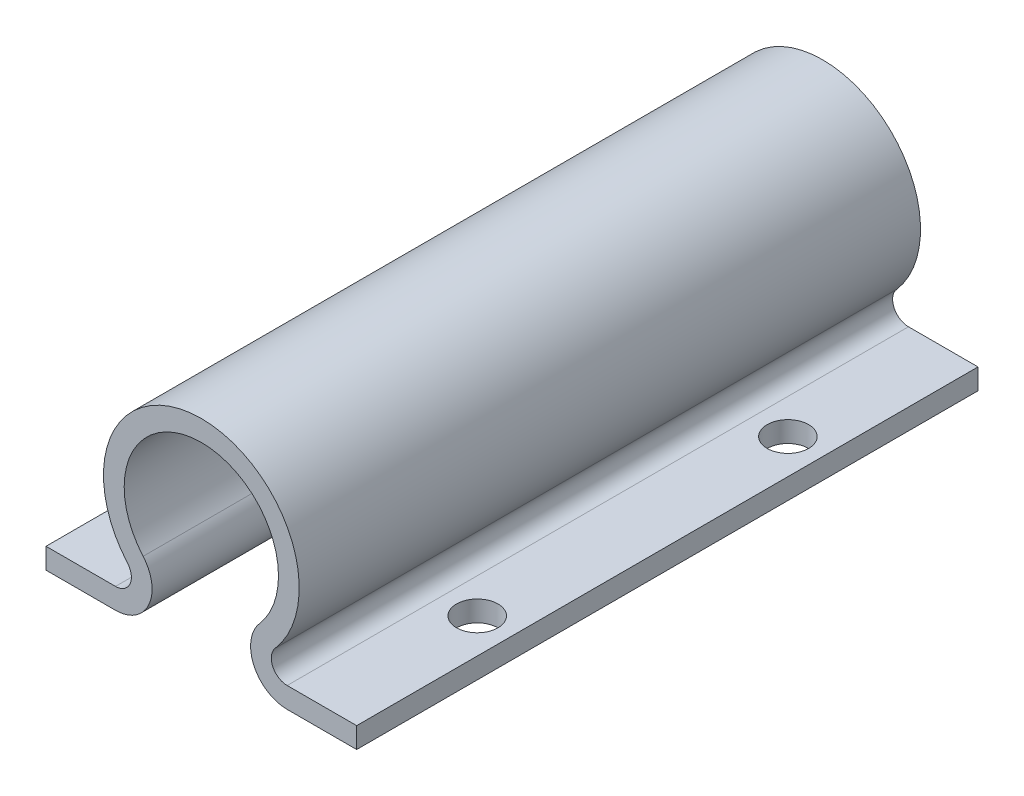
ISO-10303-21;
HEADER;
FILE_DESCRIPTION(('STEP AP214'),'2;1');
FILE_NAME('part.step','',(''),(''),'','','');
FILE_SCHEMA(('AUTOMOTIVE_DESIGN { 1 0 10303 214 1 1 1 1 }'));
ENDSEC;
DATA;
#1=APPLICATION_CONTEXT('core data for automotive mechanical design processes');
#2=APPLICATION_PROTOCOL_DEFINITION('international standard','automotive_design',2000,#1);
#3=PRODUCT_CONTEXT('',#1,'mechanical');
#4=PRODUCT('Part','Part','',(#3));
#5=PRODUCT_RELATED_PRODUCT_CATEGORY('part','',(#4));
#6=PRODUCT_DEFINITION_FORMATION('','',#4);
#7=PRODUCT_DEFINITION_CONTEXT('part definition',#1,'design');
#8=PRODUCT_DEFINITION('design','',#6,#7);
#9=PRODUCT_DEFINITION_SHAPE('','',#8);
#10=(LENGTH_UNIT() NAMED_UNIT(*) SI_UNIT(.MILLI.,.METRE.));
#11=(NAMED_UNIT(*) PLANE_ANGLE_UNIT() SI_UNIT($,.RADIAN.));
#12=(NAMED_UNIT(*) SI_UNIT($,.STERADIAN.) SOLID_ANGLE_UNIT());
#13=UNCERTAINTY_MEASURE_WITH_UNIT(LENGTH_MEASURE(1.E-05),#10,'distance_accuracy_value','');
#14=(GEOMETRIC_REPRESENTATION_CONTEXT(3) GLOBAL_UNCERTAINTY_ASSIGNED_CONTEXT((#13)) GLOBAL_UNIT_ASSIGNED_CONTEXT((#10,
#11,#12)) REPRESENTATION_CONTEXT('',''));
#15=CARTESIAN_POINT('',(0.,0.,0.));
#16=DIRECTION('',(0.,0.,1.));
#17=DIRECTION('',(1.,0.,0.));
#18=AXIS2_PLACEMENT_3D('',#15,#16,#17);
#19=CARTESIAN_POINT('',(-11.0471798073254,4.48542778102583,76.2));
#20=DIRECTION('',(0.,0.,-1.));
#21=DIRECTION('',(-1.,0.,0.));
#22=AXIS2_PLACEMENT_3D('',#19,#20,#21);
#23=CYLINDRICAL_SURFACE('',#22,4.48542778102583);
#24=CARTESIAN_POINT('',(-11.0471798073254,4.48542778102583,0.));
#25=DIRECTION('',(0.,0.,1.));
#26=DIRECTION('',(-1.,0.,0.));
#27=AXIS2_PLACEMENT_3D('',#24,#25,#26);
#28=CIRCLE('',#27,4.48542778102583);
#29=CARTESIAN_POINT('',(-11.0471798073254,0.,0.));
#30=VERTEX_POINT('',#29);
#31=CARTESIAN_POINT('',(-7.66233395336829,7.42853513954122,0.));
#32=VERTEX_POINT('',#31);
#33=EDGE_CURVE('E165',#30,#32,#28,.T.);
#34=ORIENTED_EDGE('',*,*,#33,.T.);
#35=DIRECTION('',(0.,0.,-1.));
#36=VECTOR('',#35,1.);
#37=CARTESIAN_POINT('',(-7.66233395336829,7.42853513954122,76.2));
#38=LINE('',#37,#36);
#39=CARTESIAN_POINT('',(-7.66233395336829,7.42853513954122,76.2));
#40=VERTEX_POINT('',#39);
#41=EDGE_CURVE('E11',#40,#32,#38,.T.);
#42=ORIENTED_EDGE('',*,*,#41,.F.);
#43=CARTESIAN_POINT('',(-11.0471798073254,4.48542778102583,76.2));
#44=DIRECTION('',(0.,0.,1.));
#45=DIRECTION('',(-1.,0.,0.));
#46=AXIS2_PLACEMENT_3D('',#43,#44,#45);
#47=CIRCLE('',#46,4.48542778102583);
#48=CARTESIAN_POINT('',(-11.0471798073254,0.,76.2));
#49=VERTEX_POINT('',#48);
#50=EDGE_CURVE('E188',#49,#40,#47,.T.);
#51=ORIENTED_EDGE('',*,*,#50,.F.);
#52=DIRECTION('',(0.,0.,-1.));
#53=VECTOR('',#52,1.);
#54=CARTESIAN_POINT('',(-11.0471798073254,0.,76.2));
#55=LINE('',#54,#53);
#56=EDGE_CURVE('E161',#49,#30,#55,.T.);
#57=ORIENTED_EDGE('',*,*,#56,.T.);
#58=EDGE_LOOP('',(#34,#42,#51,#57));
#59=FACE_BOUND('',#58,.T.);
#60=ADVANCED_FACE('F43',(#59),#23,.T.);
#61=CARTESIAN_POINT('',(-0.52238641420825,13.6366855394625,76.2));
#62=DIRECTION('',(0.,0.,-1.));
#63=DIRECTION('',(-1.,0.,0.));
#64=AXIS2_PLACEMENT_3D('',#61,#62,#63);
#65=CYLINDRICAL_SURFACE('',#64,9.4615);
#66=CARTESIAN_POINT('',(-0.52238641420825,13.6366855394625,0.));
#67=DIRECTION('',(0.,0.,-1.));
#68=DIRECTION('',(1.,0.,0.));
#69=AXIS2_PLACEMENT_3D('',#66,#67,#68);
#70=CIRCLE('',#69,9.4615);
#71=CARTESIAN_POINT('',(6.6175611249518,7.42853513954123,0.));
#72=VERTEX_POINT('',#71);
#73=EDGE_CURVE('E168',#32,#72,#70,.T.);
#74=ORIENTED_EDGE('',*,*,#73,.T.);
#75=DIRECTION('',(0.,0.,-1.));
#76=VECTOR('',#75,1.);
#77=CARTESIAN_POINT('',(6.6175611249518,7.42853513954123,76.2));
#78=LINE('',#77,#76);
#79=CARTESIAN_POINT('',(6.6175611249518,7.42853513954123,76.2));
#80=VERTEX_POINT('',#79);
#81=EDGE_CURVE('E52',#80,#72,#78,.T.);
#82=ORIENTED_EDGE('',*,*,#81,.F.);
#83=CARTESIAN_POINT('',(-0.52238641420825,13.6366855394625,76.2));
#84=DIRECTION('',(0.,0.,-1.));
#85=DIRECTION('',(1.,0.,0.));
#86=AXIS2_PLACEMENT_3D('',#83,#84,#85);
#87=CIRCLE('',#86,9.4615);
#88=EDGE_CURVE('E116',#40,#80,#87,.T.);
#89=ORIENTED_EDGE('',*,*,#88,.F.);
#90=ORIENTED_EDGE('',*,*,#41,.T.);
#91=EDGE_LOOP('',(#74,#82,#89,#90));
#92=FACE_BOUND('',#91,.T.);
#93=ADVANCED_FACE('F278',(#92),#65,.F.);
#94=CARTESIAN_POINT('',(10.0024069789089,4.48542778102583,76.2));
#95=DIRECTION('',(0.,0.,-1.));
#96=DIRECTION('',(-1.,0.,0.));
#97=AXIS2_PLACEMENT_3D('',#94,#95,#96);
#98=CYLINDRICAL_SURFACE('',#97,4.48542778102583);
#99=CARTESIAN_POINT('',(10.0024069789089,4.48542778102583,0.));
#100=DIRECTION('',(0.,0.,1.));
#101=DIRECTION('',(1.,0.,0.));
#102=AXIS2_PLACEMENT_3D('',#99,#100,#101);
#103=CIRCLE('',#102,4.48542778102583);
#104=CARTESIAN_POINT('',(10.0024069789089,0.,0.));
#105=VERTEX_POINT('',#104);
#106=EDGE_CURVE('E171',#72,#105,#103,.T.);
#107=ORIENTED_EDGE('',*,*,#106,.T.);
#108=DIRECTION('',(0.,0.,-1.));
#109=VECTOR('',#108,1.);
#110=CARTESIAN_POINT('',(10.0024069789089,0.,76.2));
#111=LINE('',#110,#109);
#112=CARTESIAN_POINT('',(10.0024069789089,0.,76.2));
#113=VERTEX_POINT('',#112);
#114=EDGE_CURVE('E207',#113,#105,#111,.T.);
#115=ORIENTED_EDGE('',*,*,#114,.F.);
#116=CARTESIAN_POINT('',(10.0024069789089,4.48542778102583,76.2));
#117=DIRECTION('',(0.,0.,1.));
#118=DIRECTION('',(1.,0.,0.));
#119=AXIS2_PLACEMENT_3D('',#116,#117,#118);
#120=CIRCLE('',#119,4.48542778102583);
#121=EDGE_CURVE('E236',#80,#113,#120,.T.);
#122=ORIENTED_EDGE('',*,*,#121,.F.);
#123=ORIENTED_EDGE('',*,*,#81,.T.);
#124=EDGE_LOOP('',(#107,#115,#122,#123));
#125=FACE_BOUND('',#124,.T.);
#126=ADVANCED_FACE('F282',(#125),#98,.T.);
#127=CARTESIAN_POINT('',(10.0024069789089,0.,76.2));
#128=DIRECTION('',(0.,1.,0.));
#129=DIRECTION('',(-1.,0.,0.));
#130=AXIS2_PLACEMENT_3D('',#127,#128,#129);
#131=PLANE('',#130);
#132=CARTESIAN_POINT('',(14.2650102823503,0.,57.15));
#133=DIRECTION('',(0.,1.,0.));
#134=DIRECTION('',(-1.,0.,0.));
#135=AXIS2_PLACEMENT_3D('',#132,#133,#134);
#136=CIRCLE('',#135,2.54);
#137=CARTESIAN_POINT('',(11.7250102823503,0.,57.15));
#138=VERTEX_POINT('',#137);
#139=EDGE_CURVE('E169',#138,#138,#136,.T.);
#140=ORIENTED_EDGE('',*,*,#139,.T.);
#141=EDGE_LOOP('',(#140));
#142=FACE_BOUND('',#141,.T.);
#143=CARTESIAN_POINT('',(14.2650102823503,0.,19.05));
#144=DIRECTION('',(0.,1.,0.));
#145=DIRECTION('',(-1.,0.,0.));
#146=AXIS2_PLACEMENT_3D('',#143,#144,#145);
#147=CIRCLE('',#146,2.54);
#148=CARTESIAN_POINT('',(11.7250102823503,0.,19.05));
#149=VERTEX_POINT('',#148);
#150=EDGE_CURVE('E217',#149,#149,#147,.T.);
#151=ORIENTED_EDGE('',*,*,#150,.T.);
#152=EDGE_LOOP('',(#151));
#153=FACE_BOUND('',#152,.T.);
#154=DIRECTION('',(1.,0.,0.));
#155=VECTOR('',#154,1.);
#156=CARTESIAN_POINT('',(10.0024069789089,0.,0.));
#157=LINE('',#156,#155);
#158=CARTESIAN_POINT('',(18.5276135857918,0.,0.));
#159=VERTEX_POINT('',#158);
#160=EDGE_CURVE('E173',#105,#159,#157,.T.);
#161=ORIENTED_EDGE('',*,*,#160,.T.);
#162=DIRECTION('',(0.,0.,-1.));
#163=VECTOR('',#162,1.);
#164=CARTESIAN_POINT('',(18.5276135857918,0.,76.2));
#165=LINE('',#164,#163);
#166=CARTESIAN_POINT('',(18.5276135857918,0.,76.2));
#167=VERTEX_POINT('',#166);
#168=EDGE_CURVE('E204',#167,#159,#165,.T.);
#169=ORIENTED_EDGE('',*,*,#168,.F.);
#170=DIRECTION('',(1.,0.,0.));
#171=VECTOR('',#170,1.);
#172=CARTESIAN_POINT('',(10.0024069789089,0.,76.2));
#173=LINE('',#172,#171);
#174=EDGE_CURVE('E238',#113,#167,#173,.T.);
#175=ORIENTED_EDGE('',*,*,#174,.F.);
#176=ORIENTED_EDGE('',*,*,#114,.T.);
#177=EDGE_LOOP('',(#161,#169,#175,#176));
#178=FACE_BOUND('',#177,.T.);
#179=ADVANCED_FACE('F286',(#142,#153,#178),#131,.F.);
#180=CARTESIAN_POINT('',(18.5276135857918,2.54,76.2));
#181=DIRECTION('',(-1.,0.,0.));
#182=DIRECTION('',(0.,0.,1.));
#183=AXIS2_PLACEMENT_3D('',#180,#181,#182);
#184=PLANE('',#183);
#185=DIRECTION('',(0.,1.,0.));
#186=VECTOR('',#185,1.);
#187=CARTESIAN_POINT('',(18.5276135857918,2.54,0.));
#188=LINE('',#187,#186);
#189=CARTESIAN_POINT('',(18.5276135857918,2.54,0.));
#190=VERTEX_POINT('',#189);
#191=EDGE_CURVE('E175',#159,#190,#188,.T.);
#192=ORIENTED_EDGE('',*,*,#191,.T.);
#193=DIRECTION('',(0.,0.,-1.));
#194=VECTOR('',#193,1.);
#195=CARTESIAN_POINT('',(18.5276135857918,2.54,76.2));
#196=LINE('',#195,#194);
#197=CARTESIAN_POINT('',(18.5276135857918,2.54,76.2));
#198=VERTEX_POINT('',#197);
#199=EDGE_CURVE('E201',#198,#190,#196,.T.);
#200=ORIENTED_EDGE('',*,*,#199,.F.);
#201=DIRECTION('',(0.,1.,0.));
#202=VECTOR('',#201,1.);
#203=CARTESIAN_POINT('',(18.5276135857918,2.54,76.2));
#204=LINE('',#203,#202);
#205=EDGE_CURVE('E240',#167,#198,#204,.T.);
#206=ORIENTED_EDGE('',*,*,#205,.F.);
#207=ORIENTED_EDGE('',*,*,#168,.T.);
#208=EDGE_LOOP('',(#192,#200,#206,#207));
#209=FACE_BOUND('',#208,.T.);
#210=ADVANCED_FACE('F292',(#209),#184,.F.);
#211=CARTESIAN_POINT('',(10.0024069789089,2.54,76.2));
#212=DIRECTION('',(0.,-1.,0.));
#213=DIRECTION('',(0.,0.,-1.));
#214=AXIS2_PLACEMENT_3D('',#211,#212,#213);
#215=PLANE('',#214);
#216=CARTESIAN_POINT('',(14.2650102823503,2.54,57.15));
#217=DIRECTION('',(0.,1.,0.));
#218=DIRECTION('',(0.,0.,1.));
#219=AXIS2_PLACEMENT_3D('',#216,#217,#218);
#220=CIRCLE('',#219,2.54);
#221=CARTESIAN_POINT('',(14.2650102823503,2.54,59.69));
#222=VERTEX_POINT('',#221);
#223=EDGE_CURVE('E219',#222,#222,#220,.T.);
#224=ORIENTED_EDGE('',*,*,#223,.F.);
#225=EDGE_LOOP('',(#224));
#226=FACE_BOUND('',#225,.T.);
#227=CARTESIAN_POINT('',(14.2650102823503,2.54,19.05));
#228=DIRECTION('',(0.,1.,0.));
#229=DIRECTION('',(0.,0.,1.));
#230=AXIS2_PLACEMENT_3D('',#227,#228,#229);
#231=CIRCLE('',#230,2.54);
#232=CARTESIAN_POINT('',(14.2650102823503,2.54,21.59));
#233=VERTEX_POINT('',#232);
#234=EDGE_CURVE('E213',#233,#233,#231,.T.);
#235=ORIENTED_EDGE('',*,*,#234,.F.);
#236=EDGE_LOOP('',(#235));
#237=FACE_BOUND('',#236,.T.);
#238=DIRECTION('',(-1.,0.,0.));
#239=VECTOR('',#238,1.);
#240=CARTESIAN_POINT('',(10.0024069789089,2.54,0.));
#241=LINE('',#240,#239);
#242=CARTESIAN_POINT('',(10.0024069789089,2.54,0.));
#243=VERTEX_POINT('',#242);
#244=EDGE_CURVE('E177',#190,#243,#241,.T.);
#245=ORIENTED_EDGE('',*,*,#244,.T.);
#246=DIRECTION('',(0.,0.,-1.));
#247=VECTOR('',#246,1.);
#248=CARTESIAN_POINT('',(10.0024069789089,2.54,76.2));
#249=LINE('',#248,#247);
#250=CARTESIAN_POINT('',(10.0024069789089,2.54,76.2));
#251=VERTEX_POINT('',#250);
#252=EDGE_CURVE('E198',#251,#243,#249,.T.);
#253=ORIENTED_EDGE('',*,*,#252,.F.);
#254=DIRECTION('',(-1.,0.,0.));
#255=VECTOR('',#254,1.);
#256=CARTESIAN_POINT('',(10.0024069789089,2.54,76.2));
#257=LINE('',#256,#255);
#258=EDGE_CURVE('E242',#198,#251,#257,.T.);
#259=ORIENTED_EDGE('',*,*,#258,.F.);
#260=ORIENTED_EDGE('',*,*,#199,.T.);
#261=EDGE_LOOP('',(#245,#253,#259,#260));
#262=FACE_BOUND('',#261,.T.);
#263=ADVANCED_FACE('F296',(#226,#237,#262),#215,.F.);
#264=CARTESIAN_POINT('',(10.0024069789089,4.48542778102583,76.2));
#265=DIRECTION('',(0.,0.,-1.));
#266=DIRECTION('',(-1.,0.,0.));
#267=AXIS2_PLACEMENT_3D('',#264,#265,#266);
#268=CYLINDRICAL_SURFACE('',#267,1.94542778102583);
#269=CARTESIAN_POINT('',(10.0024069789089,4.48542778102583,0.));
#270=DIRECTION('',(0.,0.,-1.));
#271=DIRECTION('',(1.,0.,0.));
#272=AXIS2_PLACEMENT_3D('',#269,#270,#271);
#273=CIRCLE('',#272,1.94542778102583);
#274=CARTESIAN_POINT('',(8.53432556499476,5.76191758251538,0.));
#275=VERTEX_POINT('',#274);
#276=EDGE_CURVE('E179',#243,#275,#273,.T.);
#277=ORIENTED_EDGE('',*,*,#276,.T.);
#278=DIRECTION('',(0.,0.,-1.));
#279=VECTOR('',#278,1.);
#280=CARTESIAN_POINT('',(8.53432556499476,5.76191758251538,76.2));
#281=LINE('',#280,#279);
#282=CARTESIAN_POINT('',(8.53432556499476,5.76191758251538,76.2));
#283=VERTEX_POINT('',#282);
#284=EDGE_CURVE('E195',#283,#275,#281,.T.);
#285=ORIENTED_EDGE('',*,*,#284,.F.);
#286=CARTESIAN_POINT('',(10.0024069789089,4.48542778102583,76.2));
#287=DIRECTION('',(0.,0.,-1.));
#288=DIRECTION('',(1.,0.,0.));
#289=AXIS2_PLACEMENT_3D('',#286,#287,#288);
#290=CIRCLE('',#289,1.94542778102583);
#291=EDGE_CURVE('E244',#251,#283,#290,.T.);
#292=ORIENTED_EDGE('',*,*,#291,.F.);
#293=ORIENTED_EDGE('',*,*,#252,.T.);
#294=EDGE_LOOP('',(#277,#285,#292,#293));
#295=FACE_BOUND('',#294,.T.);
#296=ADVANCED_FACE('F300',(#295),#268,.F.);
#297=CARTESIAN_POINT('',(-0.52238641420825,13.6366855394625,76.2));
#298=DIRECTION('',(0.,0.,-1.));
#299=DIRECTION('',(-1.,0.,0.));
#300=AXIS2_PLACEMENT_3D('',#297,#298,#299);
#301=CYLINDRICAL_SURFACE('',#300,12.0015);
#302=CARTESIAN_POINT('',(-0.52238641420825,13.6366855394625,0.));
#303=DIRECTION('',(0.,0.,1.));
#304=DIRECTION('',(1.,0.,0.));
#305=AXIS2_PLACEMENT_3D('',#302,#303,#304);
#306=CIRCLE('',#305,12.0015);
#307=CARTESIAN_POINT('',(-9.57909839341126,5.76191758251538,0.));
#308=VERTEX_POINT('',#307);
#309=EDGE_CURVE('E181',#275,#308,#306,.T.);
#310=ORIENTED_EDGE('',*,*,#309,.T.);
#311=DIRECTION('',(0.,0.,-1.));
#312=VECTOR('',#311,1.);
#313=CARTESIAN_POINT('',(-9.57909839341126,5.76191758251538,76.2));
#314=LINE('',#313,#312);
#315=CARTESIAN_POINT('',(-9.57909839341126,5.76191758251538,76.2));
#316=VERTEX_POINT('',#315);
#317=EDGE_CURVE('E192',#316,#308,#314,.T.);
#318=ORIENTED_EDGE('',*,*,#317,.F.);
#319=CARTESIAN_POINT('',(-0.52238641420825,13.6366855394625,76.2));
#320=DIRECTION('',(0.,0.,1.));
#321=DIRECTION('',(1.,0.,0.));
#322=AXIS2_PLACEMENT_3D('',#319,#320,#321);
#323=CIRCLE('',#322,12.0015);
#324=EDGE_CURVE('E246',#283,#316,#323,.T.);
#325=ORIENTED_EDGE('',*,*,#324,.F.);
#326=ORIENTED_EDGE('',*,*,#284,.T.);
#327=EDGE_LOOP('',(#310,#318,#325,#326));
#328=FACE_BOUND('',#327,.T.);
#329=ADVANCED_FACE('F252',(#328),#301,.T.);
#330=CARTESIAN_POINT('',(-11.0471798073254,4.48542778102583,76.2));
#331=DIRECTION('',(0.,0.,-1.));
#332=DIRECTION('',(-1.,0.,0.));
#333=AXIS2_PLACEMENT_3D('',#330,#331,#332);
#334=CYLINDRICAL_SURFACE('',#333,1.94542778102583);
#335=CARTESIAN_POINT('',(-11.0471798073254,4.48542778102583,0.));
#336=DIRECTION('',(0.,0.,-1.));
#337=DIRECTION('',(-1.,0.,0.));
#338=AXIS2_PLACEMENT_3D('',#335,#336,#337);
#339=CIRCLE('',#338,1.94542778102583);
#340=CARTESIAN_POINT('',(-11.0471798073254,2.54,0.));
#341=VERTEX_POINT('',#340);
#342=EDGE_CURVE('E183',#308,#341,#339,.T.);
#343=ORIENTED_EDGE('',*,*,#342,.T.);
#344=DIRECTION('',(0.,0.,-1.));
#345=VECTOR('',#344,1.);
#346=CARTESIAN_POINT('',(-11.0471798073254,2.54,76.2));
#347=LINE('',#346,#345);
#348=CARTESIAN_POINT('',(-11.0471798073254,2.54,76.2));
#349=VERTEX_POINT('',#348);
#350=EDGE_CURVE('E156',#349,#341,#347,.T.);
#351=ORIENTED_EDGE('',*,*,#350,.F.);
#352=CARTESIAN_POINT('',(-11.0471798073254,4.48542778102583,76.2));
#353=DIRECTION('',(0.,0.,-1.));
#354=DIRECTION('',(-1.,0.,0.));
#355=AXIS2_PLACEMENT_3D('',#352,#353,#354);
#356=CIRCLE('',#355,1.94542778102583);
#357=EDGE_CURVE('E147',#316,#349,#356,.T.);
#358=ORIENTED_EDGE('',*,*,#357,.F.);
#359=ORIENTED_EDGE('',*,*,#317,.T.);
#360=EDGE_LOOP('',(#343,#351,#358,#359));
#361=FACE_BOUND('',#360,.T.);
#362=ADVANCED_FACE('F256',(#361),#334,.F.);
#363=CARTESIAN_POINT('',(-11.0471798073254,2.54,76.2));
#364=DIRECTION('',(0.,-1.,0.));
#365=DIRECTION('',(1.,0.,0.));
#366=AXIS2_PLACEMENT_3D('',#363,#364,#365);
#367=PLANE('',#366);
#368=CARTESIAN_POINT('',(-15.3097831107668,2.54,19.05));
#369=DIRECTION('',(0.,1.,0.));
#370=DIRECTION('',(0.,0.,-1.));
#371=AXIS2_PLACEMENT_3D('',#368,#369,#370);
#372=CIRCLE('',#371,2.54);
#373=CARTESIAN_POINT('',(-15.3097831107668,2.54,16.51));
#374=VERTEX_POINT('',#373);
#375=EDGE_CURVE('E228',#374,#374,#372,.T.);
#376=ORIENTED_EDGE('',*,*,#375,.F.);
#377=EDGE_LOOP('',(#376));
#378=FACE_BOUND('',#377,.T.);
#379=CARTESIAN_POINT('',(-15.3097831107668,2.54,57.15));
#380=DIRECTION('',(0.,1.,0.));
#381=DIRECTION('',(0.,0.,-1.));
#382=AXIS2_PLACEMENT_3D('',#379,#380,#381);
#383=CIRCLE('',#382,2.54);
#384=CARTESIAN_POINT('',(-15.3097831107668,2.54,54.61));
#385=VERTEX_POINT('',#384);
#386=EDGE_CURVE('E224',#385,#385,#383,.T.);
#387=ORIENTED_EDGE('',*,*,#386,.F.);
#388=EDGE_LOOP('',(#387));
#389=FACE_BOUND('',#388,.T.);
#390=DIRECTION('',(-1.,0.,0.));
#391=VECTOR('',#390,1.);
#392=CARTESIAN_POINT('',(-11.0471798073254,2.54,0.));
#393=LINE('',#392,#391);
#394=CARTESIAN_POINT('',(-19.5723864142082,2.54,0.));
#395=VERTEX_POINT('',#394);
#396=EDGE_CURVE('E155',#341,#395,#393,.T.);
#397=ORIENTED_EDGE('',*,*,#396,.T.);
#398=DIRECTION('',(0.,0.,-1.));
#399=VECTOR('',#398,1.);
#400=CARTESIAN_POINT('',(-19.5723864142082,2.54,76.2));
#401=LINE('',#400,#399);
#402=CARTESIAN_POINT('',(-19.5723864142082,2.54,76.2));
#403=VERTEX_POINT('',#402);
#404=EDGE_CURVE('E152',#403,#395,#401,.T.);
#405=ORIENTED_EDGE('',*,*,#404,.F.);
#406=DIRECTION('',(-1.,0.,0.));
#407=VECTOR('',#406,1.);
#408=CARTESIAN_POINT('',(-11.0471798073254,2.54,76.2));
#409=LINE('',#408,#407);
#410=EDGE_CURVE('E141',#349,#403,#409,.T.);
#411=ORIENTED_EDGE('',*,*,#410,.F.);
#412=ORIENTED_EDGE('',*,*,#350,.T.);
#413=EDGE_LOOP('',(#397,#405,#411,#412));
#414=FACE_BOUND('',#413,.T.);
#415=ADVANCED_FACE('F153',(#378,#389,#414),#367,.F.);
#416=CARTESIAN_POINT('',(-19.5723864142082,2.54,76.2));
#417=DIRECTION('',(1.,0.,0.));
#418=DIRECTION('',(0.,0.,-1.));
#419=AXIS2_PLACEMENT_3D('',#416,#417,#418);
#420=PLANE('',#419);
#421=DIRECTION('',(0.,-1.,0.));
#422=VECTOR('',#421,1.);
#423=CARTESIAN_POINT('',(-19.5723864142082,2.54,0.));
#424=LINE('',#423,#422);
#425=CARTESIAN_POINT('',(-19.5723864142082,0.,0.));
#426=VERTEX_POINT('',#425);
#427=EDGE_CURVE('E102',#395,#426,#424,.T.);
#428=ORIENTED_EDGE('',*,*,#427,.T.);
#429=DIRECTION('',(0.,0.,-1.));
#430=VECTOR('',#429,1.);
#431=CARTESIAN_POINT('',(-19.5723864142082,0.,76.2));
#432=LINE('',#431,#430);
#433=CARTESIAN_POINT('',(-19.5723864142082,0.,76.2));
#434=VERTEX_POINT('',#433);
#435=EDGE_CURVE('E157',#434,#426,#432,.T.);
#436=ORIENTED_EDGE('',*,*,#435,.F.);
#437=DIRECTION('',(0.,-1.,0.));
#438=VECTOR('',#437,1.);
#439=CARTESIAN_POINT('',(-19.5723864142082,2.54,76.2));
#440=LINE('',#439,#438);
#441=EDGE_CURVE('E145',#403,#434,#440,.T.);
#442=ORIENTED_EDGE('',*,*,#441,.F.);
#443=ORIENTED_EDGE('',*,*,#404,.T.);
#444=EDGE_LOOP('',(#428,#436,#442,#443));
#445=FACE_BOUND('',#444,.T.);
#446=ADVANCED_FACE('F159',(#445),#420,.F.);
#447=CARTESIAN_POINT('',(-11.0471798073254,0.,76.2));
#448=DIRECTION('',(0.,1.,0.));
#449=DIRECTION('',(-1.,0.,0.));
#450=AXIS2_PLACEMENT_3D('',#447,#448,#449);
#451=PLANE('',#450);
#452=CARTESIAN_POINT('',(-15.3097831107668,0.,19.05));
#453=DIRECTION('',(0.,1.,0.));
#454=DIRECTION('',(-1.,0.,0.));
#455=AXIS2_PLACEMENT_3D('',#452,#453,#454);
#456=CIRCLE('',#455,2.54);
#457=CARTESIAN_POINT('',(-17.8497831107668,0.,19.05));
#458=VERTEX_POINT('',#457);
#459=EDGE_CURVE('E46',#458,#458,#456,.T.);
#460=ORIENTED_EDGE('',*,*,#459,.T.);
#461=EDGE_LOOP('',(#460));
#462=FACE_BOUND('',#461,.T.);
#463=CARTESIAN_POINT('',(-15.3097831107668,0.,57.15));
#464=DIRECTION('',(0.,1.,0.));
#465=DIRECTION('',(-1.,0.,0.));
#466=AXIS2_PLACEMENT_3D('',#463,#464,#465);
#467=CIRCLE('',#466,2.54);
#468=CARTESIAN_POINT('',(-17.8497831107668,0.,57.15));
#469=VERTEX_POINT('',#468);
#470=EDGE_CURVE('E211',#469,#469,#467,.T.);
#471=ORIENTED_EDGE('',*,*,#470,.T.);
#472=EDGE_LOOP('',(#471));
#473=FACE_BOUND('',#472,.T.);
#474=DIRECTION('',(1.,0.,0.));
#475=VECTOR('',#474,1.);
#476=CARTESIAN_POINT('',(-11.0471798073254,0.,0.));
#477=LINE('',#476,#475);
#478=EDGE_CURVE('E108',#426,#30,#477,.T.);
#479=ORIENTED_EDGE('',*,*,#478,.T.);
#480=ORIENTED_EDGE('',*,*,#56,.F.);
#481=DIRECTION('',(1.,0.,0.));
#482=VECTOR('',#481,1.);
#483=CARTESIAN_POINT('',(-11.0471798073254,0.,76.2));
#484=LINE('',#483,#482);
#485=EDGE_CURVE('E61',#434,#49,#484,.T.);
#486=ORIENTED_EDGE('',*,*,#485,.F.);
#487=ORIENTED_EDGE('',*,*,#435,.T.);
#488=EDGE_LOOP('',(#479,#480,#486,#487));
#489=FACE_BOUND('',#488,.T.);
#490=ADVANCED_FACE('F264',(#462,#473,#489),#451,.F.);
#491=CARTESIAN_POINT('',(-11.0471798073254,4.48542778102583,76.2));
#492=DIRECTION('',(0.,0.,-1.));
#493=DIRECTION('',(-1.,0.,0.));
#494=AXIS2_PLACEMENT_3D('',#491,#492,#493);
#495=PLANE('',#494);
#496=ORIENTED_EDGE('',*,*,#50,.T.);
#497=ORIENTED_EDGE('',*,*,#88,.T.);
#498=ORIENTED_EDGE('',*,*,#121,.T.);
#499=ORIENTED_EDGE('',*,*,#174,.T.);
#500=ORIENTED_EDGE('',*,*,#205,.T.);
#501=ORIENTED_EDGE('',*,*,#258,.T.);
#502=ORIENTED_EDGE('',*,*,#291,.T.);
#503=ORIENTED_EDGE('',*,*,#324,.T.);
#504=ORIENTED_EDGE('',*,*,#357,.T.);
#505=ORIENTED_EDGE('',*,*,#410,.T.);
#506=ORIENTED_EDGE('',*,*,#441,.T.);
#507=ORIENTED_EDGE('',*,*,#485,.T.);
#508=EDGE_LOOP('',(#496,#497,#498,#499,#500,#501,#502,#503,#504,#505,#506,#507));
#509=FACE_BOUND('',#508,.T.);
#510=ADVANCED_FACE('F143',(#509),#495,.F.);
#511=CARTESIAN_POINT('',(-11.0471798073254,4.48542778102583,0.));
#512=DIRECTION('',(0.,0.,-1.));
#513=DIRECTION('',(-1.,0.,0.));
#514=AXIS2_PLACEMENT_3D('',#511,#512,#513);
#515=PLANE('',#514);
#516=ORIENTED_EDGE('',*,*,#33,.F.);
#517=ORIENTED_EDGE('',*,*,#478,.F.);
#518=ORIENTED_EDGE('',*,*,#427,.F.);
#519=ORIENTED_EDGE('',*,*,#396,.F.);
#520=ORIENTED_EDGE('',*,*,#342,.F.);
#521=ORIENTED_EDGE('',*,*,#309,.F.);
#522=ORIENTED_EDGE('',*,*,#276,.F.);
#523=ORIENTED_EDGE('',*,*,#244,.F.);
#524=ORIENTED_EDGE('',*,*,#191,.F.);
#525=ORIENTED_EDGE('',*,*,#160,.F.);
#526=ORIENTED_EDGE('',*,*,#106,.F.);
#527=ORIENTED_EDGE('',*,*,#73,.F.);
#528=EDGE_LOOP('',(#516,#517,#518,#519,#520,#521,#522,#523,#524,#525,#526,#527));
#529=FACE_BOUND('',#528,.T.);
#530=ADVANCED_FACE('F259',(#529),#515,.T.);
#531=CARTESIAN_POINT('',(-15.3097831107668,-2.54,57.15));
#532=DIRECTION('',(0.,1.,0.));
#533=DIRECTION('',(0.,0.,1.));
#534=AXIS2_PLACEMENT_3D('',#531,#532,#533);
#535=CYLINDRICAL_SURFACE('',#534,2.54);
#536=ORIENTED_EDGE('',*,*,#386,.T.);
#537=EDGE_LOOP('',(#536));
#538=FACE_BOUND('',#537,.T.);
#539=ORIENTED_EDGE('',*,*,#470,.F.);
#540=EDGE_LOOP('',(#539));
#541=FACE_BOUND('',#540,.T.);
#542=ADVANCED_FACE('F323',(#538,#541),#535,.F.);
#543=CARTESIAN_POINT('',(-15.3097831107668,-2.54,19.05));
#544=DIRECTION('',(0.,1.,0.));
#545=DIRECTION('',(0.,0.,1.));
#546=AXIS2_PLACEMENT_3D('',#543,#544,#545);
#547=CYLINDRICAL_SURFACE('',#546,2.54);
#548=ORIENTED_EDGE('',*,*,#375,.T.);
#549=EDGE_LOOP('',(#548));
#550=FACE_BOUND('',#549,.T.);
#551=ORIENTED_EDGE('',*,*,#459,.F.);
#552=EDGE_LOOP('',(#551));
#553=FACE_BOUND('',#552,.T.);
#554=ADVANCED_FACE('F319',(#550,#553),#547,.F.);
#555=CARTESIAN_POINT('',(14.2650102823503,-2.54,19.05));
#556=DIRECTION('',(0.,1.,0.));
#557=DIRECTION('',(0.,0.,1.));
#558=AXIS2_PLACEMENT_3D('',#555,#556,#557);
#559=CYLINDRICAL_SURFACE('',#558,2.54);
#560=ORIENTED_EDGE('',*,*,#234,.T.);
#561=EDGE_LOOP('',(#560));
#562=FACE_BOUND('',#561,.T.);
#563=ORIENTED_EDGE('',*,*,#150,.F.);
#564=EDGE_LOOP('',(#563));
#565=FACE_BOUND('',#564,.T.);
#566=ADVANCED_FACE('F322',(#562,#565),#559,.F.);
#567=CARTESIAN_POINT('',(14.2650102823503,-2.54,57.15));
#568=DIRECTION('',(0.,1.,0.));
#569=DIRECTION('',(0.,0.,1.));
#570=AXIS2_PLACEMENT_3D('',#567,#568,#569);
#571=CYLINDRICAL_SURFACE('',#570,2.54);
#572=ORIENTED_EDGE('',*,*,#223,.T.);
#573=EDGE_LOOP('',(#572));
#574=FACE_BOUND('',#573,.T.);
#575=ORIENTED_EDGE('',*,*,#139,.F.);
#576=EDGE_LOOP('',(#575));
#577=FACE_BOUND('',#576,.T.);
#578=ADVANCED_FACE('F329',(#574,#577),#571,.F.);
#579=CLOSED_SHELL('',(#60,#93,#126,#179,#210,#263,#296,#329,#362,#415,#446,#490,#510,#530,#542,
#554,#566,#578));
#580=MANIFOLD_SOLID_BREP('B2',#579);
#581=ADVANCED_BREP_SHAPE_REPRESENTATION('',(#18,#580),#14);
#582=SHAPE_DEFINITION_REPRESENTATION(#9,#581);
ENDSEC;
END-ISO-10303-21;
